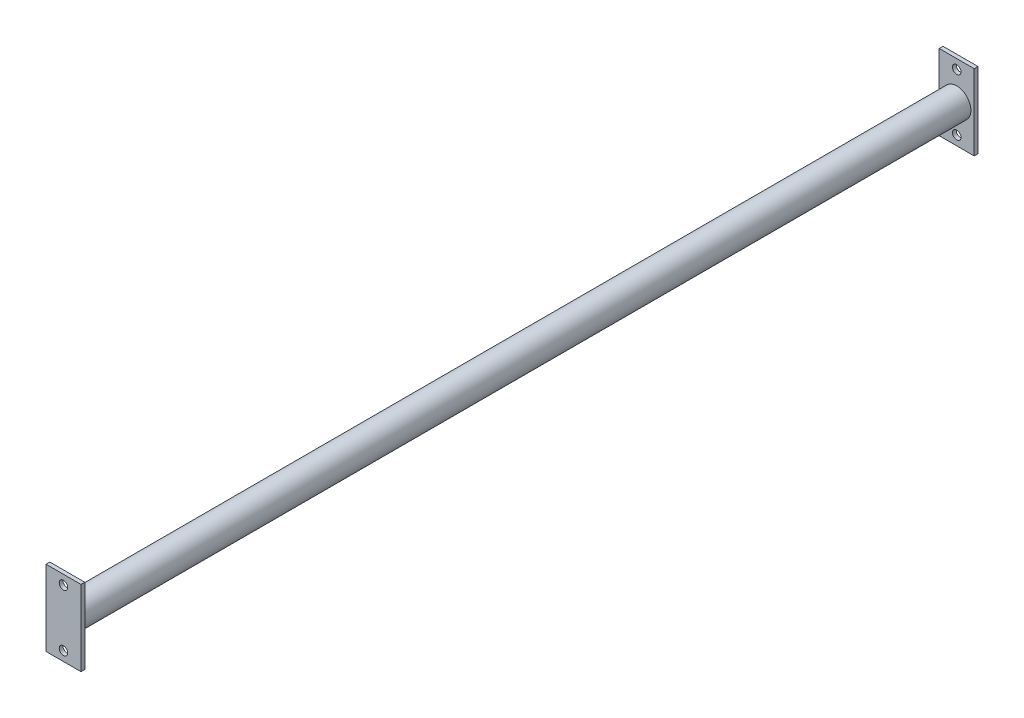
from build123d import *

# Parameters (mm, degrees)
ESQUISSE1_R      = 15
ESQUISSE1_R_2    = 14
EXTRUSION1_DEPTH = 470.5
ESQUISSE2_W      = 37
ESQUISSE2_H      = 80
ESQUISSE2_R      = 4.5
EXTRUSION2_DEPTH = 4


with BuildPart() as part:
    # Esquisse1 → Extrusion1 (new body)
    with BuildSketch(Plane.XY):
        Circle(ESQUISSE1_R)
        Circle(ESQUISSE1_R_2, mode=Mode.SUBTRACT)
    extrusion1 = extrude(amount=EXTRUSION1_DEPTH)

    # Esquisse2 → Extrusion2 (add)
    with BuildSketch(Plane.XY.offset(470.5)):
        Rectangle(ESQUISSE2_W, ESQUISSE2_H)
        with Locations((0, -30)):
            Circle(ESQUISSE2_R, mode=Mode.SUBTRACT)
        with Locations((0, 30)):
            Circle(ESQUISSE2_R, mode=Mode.SUBTRACT)
    extrusion2 = extrude(amount=EXTRUSION2_DEPTH)

    # Sym_trie3: Extrusion1, Extrusion2 across plane
    add(extrusion1.mirror(Plane.XY))
    add(extrusion2.mirror(Plane.XY))


solid = part.part
